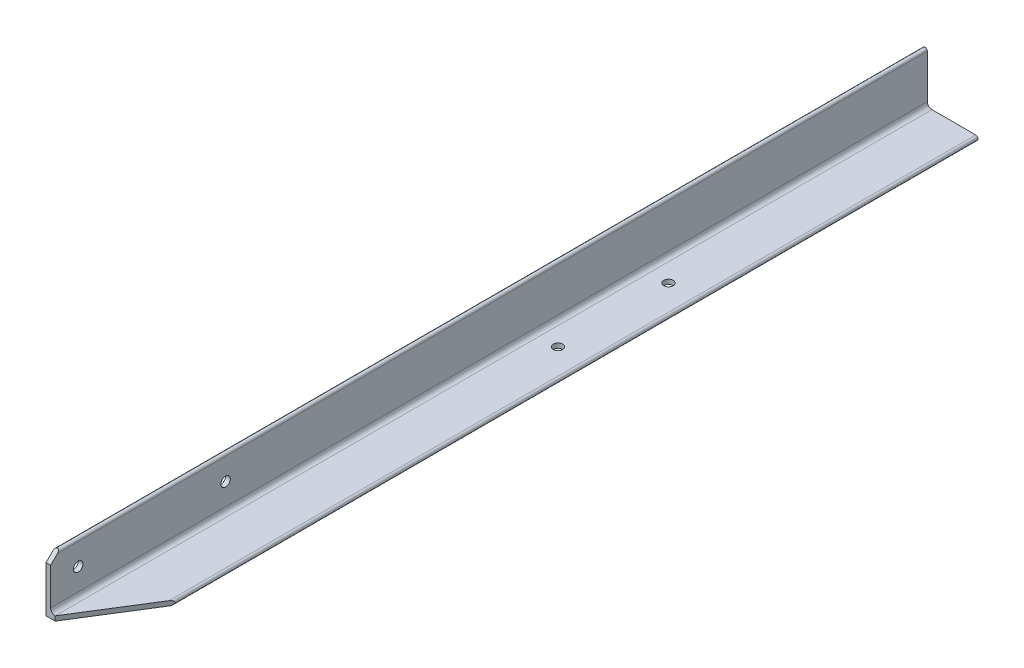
ISO-10303-21;
HEADER;
FILE_DESCRIPTION(('STEP AP214'),'2;1');
FILE_NAME('part.step','',(''),(''),'','','');
FILE_SCHEMA(('AUTOMOTIVE_DESIGN { 1 0 10303 214 1 1 1 1 }'));
ENDSEC;
DATA;
#1=APPLICATION_CONTEXT('core data for automotive mechanical design processes');
#2=APPLICATION_PROTOCOL_DEFINITION('international standard','automotive_design',2000,#1);
#3=PRODUCT_CONTEXT('',#1,'mechanical');
#4=PRODUCT('Part','Part','',(#3));
#5=PRODUCT_RELATED_PRODUCT_CATEGORY('part','',(#4));
#6=PRODUCT_DEFINITION_FORMATION('','',#4);
#7=PRODUCT_DEFINITION_CONTEXT('part definition',#1,'design');
#8=PRODUCT_DEFINITION('design','',#6,#7);
#9=PRODUCT_DEFINITION_SHAPE('','',#8);
#10=(LENGTH_UNIT() NAMED_UNIT(*) SI_UNIT(.MILLI.,.METRE.));
#11=(NAMED_UNIT(*) PLANE_ANGLE_UNIT() SI_UNIT($,.RADIAN.));
#12=(NAMED_UNIT(*) SI_UNIT($,.STERADIAN.) SOLID_ANGLE_UNIT());
#13=UNCERTAINTY_MEASURE_WITH_UNIT(LENGTH_MEASURE(1.E-05),#10,'distance_accuracy_value','');
#14=(GEOMETRIC_REPRESENTATION_CONTEXT(3) GLOBAL_UNCERTAINTY_ASSIGNED_CONTEXT((#13)) GLOBAL_UNIT_ASSIGNED_CONTEXT((#10,
#11,#12)) REPRESENTATION_CONTEXT('',''));
#15=CARTESIAN_POINT('',(0.,0.,0.));
#16=DIRECTION('',(0.,0.,1.));
#17=DIRECTION('',(1.,0.,0.));
#18=AXIS2_PLACEMENT_3D('',#15,#16,#17);
#19=CARTESIAN_POINT('',(0.,0.,302.24603));
#20=DIRECTION('',(0.,1.,0.));
#21=DIRECTION('',(-1.,0.,0.));
#22=AXIS2_PLACEMENT_3D('',#19,#20,#21);
#23=PLANE('',#22);
#24=CARTESIAN_POINT('',(19.0500000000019,0.,-107.888534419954));
#25=DIRECTION('',(0.,1.,0.));
#26=DIRECTION('',(-1.,0.,0.));
#27=AXIS2_PLACEMENT_3D('',#24,#25,#26);
#28=CIRCLE('',#27,3.2385);
#29=CARTESIAN_POINT('',(22.2885000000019,0.,-107.888534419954));
#30=VERTEX_POINT('',#29);
#31=EDGE_CURVE('E162',#30,#30,#28,.T.);
#32=ORIENTED_EDGE('',*,*,#31,.T.);
#33=EDGE_LOOP('',(#32));
#34=FACE_BOUND('',#33,.T.);
#35=CARTESIAN_POINT('',(19.0500000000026,0.,-31.6885344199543));
#36=DIRECTION('',(0.,1.,0.));
#37=DIRECTION('',(-1.,0.,0.));
#38=AXIS2_PLACEMENT_3D('',#35,#36,#37);
#39=CIRCLE('',#38,3.2385);
#40=CARTESIAN_POINT('',(22.2885000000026,0.,-31.6885344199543));
#41=VERTEX_POINT('',#40);
#42=EDGE_CURVE('E116',#41,#41,#39,.T.);
#43=ORIENTED_EDGE('',*,*,#42,.T.);
#44=EDGE_LOOP('',(#43));
#45=FACE_BOUND('',#44,.T.);
#46=DIRECTION('',(0.,0.,-1.));
#47=VECTOR('',#46,1.);
#48=CARTESIAN_POINT('',(36.5125,0.,302.24603));
#49=LINE('',#48,#47);
#50=CARTESIAN_POINT('',(36.5125,0.,253.98603));
#51=VERTEX_POINT('',#50);
#52=CARTESIAN_POINT('',(36.5125,0.,-302.24603));
#53=VERTEX_POINT('',#52);
#54=EDGE_CURVE('E40',#51,#53,#49,.T.);
#55=ORIENTED_EDGE('',*,*,#54,.F.);
#56=DIRECTION('',(0.52999894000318,0.,-0.847998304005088));
#57=VECTOR('',#56,1.);
#58=CARTESIAN_POINT('',(38.1,0.,251.44603));
#59=LINE('',#58,#57);
#60=CARTESIAN_POINT('',(6.35,0.,302.24603));
#61=VERTEX_POINT('',#60);
#62=EDGE_CURVE('E109',#61,#51,#59,.T.);
#63=ORIENTED_EDGE('',*,*,#62,.F.);
#64=DIRECTION('',(1.,0.,0.));
#65=VECTOR('',#64,1.);
#66=CARTESIAN_POINT('',(0.,0.,302.24603));
#67=LINE('',#66,#65);
#68=CARTESIAN_POINT('',(0.,0.,302.24603));
#69=VERTEX_POINT('',#68);
#70=EDGE_CURVE('E114',#69,#61,#67,.T.);
#71=ORIENTED_EDGE('',*,*,#70,.F.);
#72=DIRECTION('',(0.,0.,-1.));
#73=VECTOR('',#72,1.);
#74=CARTESIAN_POINT('',(0.,0.,302.24603));
#75=LINE('',#74,#73);
#76=CARTESIAN_POINT('',(0.,0.,-302.24603));
#77=VERTEX_POINT('',#76);
#78=EDGE_CURVE('E132',#69,#77,#75,.T.);
#79=ORIENTED_EDGE('',*,*,#78,.T.);
#80=DIRECTION('',(1.,0.,0.));
#81=VECTOR('',#80,1.);
#82=CARTESIAN_POINT('',(0.,0.,-302.24603));
#83=LINE('',#82,#81);
#84=EDGE_CURVE('E133',#77,#53,#83,.T.);
#85=ORIENTED_EDGE('',*,*,#84,.T.);
#86=EDGE_LOOP('',(#55,#63,#71,#79,#85));
#87=FACE_BOUND('',#86,.T.);
#88=ADVANCED_FACE('F32',(#34,#45,#87),#23,.F.);
#89=CARTESIAN_POINT('',(36.5125,1.5875,302.24603));
#90=DIRECTION('',(0.,0.,-1.));
#91=DIRECTION('',(-1.,0.,0.));
#92=AXIS2_PLACEMENT_3D('',#89,#90,#91);
#93=CYLINDRICAL_SURFACE('',#92,1.5875);
#94=CARTESIAN_POINT('',(36.5125,1.5875,253.98603));
#95=DIRECTION('',(-0.847998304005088,0.,-0.52999894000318));
#96=DIRECTION('',(0.52999894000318,0.,-0.847998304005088));
#97=AXIS2_PLACEMENT_3D('',#94,#95,#96);
#98=ELLIPSE('',#97,2.99528900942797,1.5875);
#99=CARTESIAN_POINT('',(36.5125,3.175,253.98603));
#100=VERTEX_POINT('',#99);
#101=EDGE_CURVE('E174',#100,#51,#98,.T.);
#102=ORIENTED_EDGE('',*,*,#101,.T.);
#103=ORIENTED_EDGE('',*,*,#54,.T.);
#104=CARTESIAN_POINT('',(36.5125,1.5875,-302.24603));
#105=DIRECTION('',(0.,0.,1.));
#106=DIRECTION('',(1.,0.,0.));
#107=AXIS2_PLACEMENT_3D('',#104,#105,#106);
#108=CIRCLE('',#107,1.5875);
#109=CARTESIAN_POINT('',(36.5125,3.175,-302.24603));
#110=VERTEX_POINT('',#109);
#111=EDGE_CURVE('E135',#53,#110,#108,.T.);
#112=ORIENTED_EDGE('',*,*,#111,.T.);
#113=DIRECTION('',(0.,0.,-1.));
#114=VECTOR('',#113,1.);
#115=CARTESIAN_POINT('',(36.5125,3.175,302.24603));
#116=LINE('',#115,#114);
#117=EDGE_CURVE('E158',#100,#110,#116,.T.);
#118=ORIENTED_EDGE('',*,*,#117,.F.);
#119=EDGE_LOOP('',(#102,#103,#112,#118));
#120=FACE_BOUND('',#119,.T.);
#121=ADVANCED_FACE('F223',(#120),#93,.T.);
#122=CARTESIAN_POINT('',(6.35000000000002,3.175,302.24603));
#123=DIRECTION('',(0.,-1.,0.));
#124=DIRECTION('',(0.,0.,-1.));
#125=AXIS2_PLACEMENT_3D('',#122,#123,#124);
#126=PLANE('',#125);
#127=CARTESIAN_POINT('',(19.0500000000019,3.175,-107.888534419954));
#128=DIRECTION('',(0.,-1.,0.));
#129=DIRECTION('',(0.,0.,-1.));
#130=AXIS2_PLACEMENT_3D('',#127,#128,#129);
#131=CIRCLE('',#130,3.2385);
#132=CARTESIAN_POINT('',(22.2885000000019,3.175,-107.888534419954));
#133=VERTEX_POINT('',#132);
#134=EDGE_CURVE('E35',#133,#133,#131,.T.);
#135=ORIENTED_EDGE('',*,*,#134,.T.);
#136=EDGE_LOOP('',(#135));
#137=FACE_BOUND('',#136,.T.);
#138=CARTESIAN_POINT('',(19.0500000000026,3.175,-31.6885344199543));
#139=DIRECTION('',(0.,-1.,0.));
#140=DIRECTION('',(0.,0.,-1.));
#141=AXIS2_PLACEMENT_3D('',#138,#139,#140);
#142=CIRCLE('',#141,3.2385);
#143=CARTESIAN_POINT('',(22.2885000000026,3.175,-31.6885344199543));
#144=VERTEX_POINT('',#143);
#145=EDGE_CURVE('E160',#144,#144,#142,.T.);
#146=ORIENTED_EDGE('',*,*,#145,.T.);
#147=EDGE_LOOP('',(#146));
#148=FACE_BOUND('',#147,.T.);
#149=DIRECTION('',(0.,0.,-1.));
#150=VECTOR('',#149,1.);
#151=CARTESIAN_POINT('',(6.35000000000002,3.175,302.24603));
#152=LINE('',#151,#150);
#153=CARTESIAN_POINT('',(6.35000000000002,3.175,302.24603));
#154=VERTEX_POINT('',#153);
#155=CARTESIAN_POINT('',(6.35000000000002,3.175,-302.24603));
#156=VERTEX_POINT('',#155);
#157=EDGE_CURVE('E155',#154,#156,#152,.T.);
#158=ORIENTED_EDGE('',*,*,#157,.F.);
#159=DIRECTION('',(0.52999894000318,0.,-0.847998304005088));
#160=VECTOR('',#159,1.);
#161=CARTESIAN_POINT('',(6.35,3.175,302.24603));
#162=LINE('',#161,#160);
#163=EDGE_CURVE('E91',#154,#100,#162,.T.);
#164=ORIENTED_EDGE('',*,*,#163,.T.);
#165=ORIENTED_EDGE('',*,*,#117,.T.);
#166=DIRECTION('',(-1.,0.,0.));
#167=VECTOR('',#166,1.);
#168=CARTESIAN_POINT('',(6.35000000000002,3.175,-302.24603));
#169=LINE('',#168,#167);
#170=EDGE_CURVE('E138',#110,#156,#169,.T.);
#171=ORIENTED_EDGE('',*,*,#170,.T.);
#172=EDGE_LOOP('',(#158,#164,#165,#171));
#173=FACE_BOUND('',#172,.T.);
#174=ADVANCED_FACE('F227',(#137,#148,#173),#126,.F.);
#175=CARTESIAN_POINT('',(6.35,6.35,302.24603));
#176=DIRECTION('',(0.,0.,-1.));
#177=DIRECTION('',(-1.,0.,0.));
#178=AXIS2_PLACEMENT_3D('',#175,#176,#177);
#179=CYLINDRICAL_SURFACE('',#178,3.175);
#180=CARTESIAN_POINT('',(6.35,6.35,-302.24603));
#181=DIRECTION('',(0.,0.,-1.));
#182=DIRECTION('',(1.,0.,0.));
#183=AXIS2_PLACEMENT_3D('',#180,#181,#182);
#184=CIRCLE('',#183,3.175);
#185=CARTESIAN_POINT('',(3.175,6.35000000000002,-302.24603));
#186=VERTEX_POINT('',#185);
#187=EDGE_CURVE('E140',#156,#186,#184,.T.);
#188=ORIENTED_EDGE('',*,*,#187,.T.);
#189=DIRECTION('',(0.,0.,-1.));
#190=VECTOR('',#189,1.);
#191=CARTESIAN_POINT('',(3.175,6.35000000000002,302.24603));
#192=LINE('',#191,#190);
#193=CARTESIAN_POINT('',(3.175,6.35000000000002,302.24603));
#194=VERTEX_POINT('',#193);
#195=EDGE_CURVE('E152',#194,#186,#192,.T.);
#196=ORIENTED_EDGE('',*,*,#195,.F.);
#197=CARTESIAN_POINT('',(6.35,6.35,302.24603));
#198=DIRECTION('',(0.,0.,-1.));
#199=DIRECTION('',(1.,0.,0.));
#200=AXIS2_PLACEMENT_3D('',#197,#198,#199);
#201=CIRCLE('',#200,3.175);
#202=EDGE_CURVE('E119',#154,#194,#201,.T.);
#203=ORIENTED_EDGE('',*,*,#202,.F.);
#204=ORIENTED_EDGE('',*,*,#157,.T.);
#205=EDGE_LOOP('',(#188,#196,#203,#204));
#206=FACE_BOUND('',#205,.T.);
#207=ADVANCED_FACE('F294',(#206),#179,.F.);
#208=CARTESIAN_POINT('',(3.175,6.35000000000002,302.24603));
#209=DIRECTION('',(-1.,0.,0.));
#210=DIRECTION('',(0.,0.,1.));
#211=AXIS2_PLACEMENT_3D('',#208,#209,#210);
#212=PLANE('',#211);
#213=CARTESIAN_POINT('',(3.175,21.43125,283.19603));
#214=DIRECTION('',(1.,0.,0.));
#215=DIRECTION('',(0.,0.,-1.));
#216=AXIS2_PLACEMENT_3D('',#213,#214,#215);
#217=CIRCLE('',#216,3.23850000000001);
#218=CARTESIAN_POINT('',(3.175,21.43125,279.95753));
#219=VERTEX_POINT('',#218);
#220=EDGE_CURVE('E181',#219,#219,#217,.T.);
#221=ORIENTED_EDGE('',*,*,#220,.F.);
#222=EDGE_LOOP('',(#221));
#223=FACE_BOUND('',#222,.T.);
#224=CARTESIAN_POINT('',(3.175,21.43125,181.59603));
#225=DIRECTION('',(1.,0.,0.));
#226=DIRECTION('',(0.,0.,-1.));
#227=AXIS2_PLACEMENT_3D('',#224,#225,#226);
#228=CIRCLE('',#227,3.23850000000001);
#229=CARTESIAN_POINT('',(3.175,21.43125,178.35753));
#230=VERTEX_POINT('',#229);
#231=EDGE_CURVE('E176',#230,#230,#228,.T.);
#232=ORIENTED_EDGE('',*,*,#231,.F.);
#233=EDGE_LOOP('',(#232));
#234=FACE_BOUND('',#233,.T.);
#235=DIRECTION('',(0.,0.,-1.));
#236=VECTOR('',#235,1.);
#237=CARTESIAN_POINT('',(3.175,36.5125,302.24603));
#238=LINE('',#237,#236);
#239=CARTESIAN_POINT('',(3.175,36.5125,297.48353));
#240=VERTEX_POINT('',#239);
#241=CARTESIAN_POINT('',(3.175,36.5125,-302.24603));
#242=VERTEX_POINT('',#241);
#243=EDGE_CURVE('E150',#240,#242,#238,.T.);
#244=ORIENTED_EDGE('',*,*,#243,.F.);
#245=DIRECTION('',(0.,0.707106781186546,-0.707106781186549));
#246=VECTOR('',#245,1.);
#247=CARTESIAN_POINT('',(3.175,31.75,302.24603));
#248=LINE('',#247,#246);
#249=CARTESIAN_POINT('',(3.175,31.75,302.24603));
#250=VERTEX_POINT('',#249);
#251=EDGE_CURVE('E180',#250,#240,#248,.T.);
#252=ORIENTED_EDGE('',*,*,#251,.F.);
#253=DIRECTION('',(0.,1.,0.));
#254=VECTOR('',#253,1.);
#255=CARTESIAN_POINT('',(3.175,6.35000000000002,302.24603));
#256=LINE('',#255,#254);
#257=EDGE_CURVE('E121',#194,#250,#256,.T.);
#258=ORIENTED_EDGE('',*,*,#257,.F.);
#259=ORIENTED_EDGE('',*,*,#195,.T.);
#260=DIRECTION('',(0.,1.,0.));
#261=VECTOR('',#260,1.);
#262=CARTESIAN_POINT('',(3.175,6.35000000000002,-302.24603));
#263=LINE('',#262,#261);
#264=EDGE_CURVE('E142',#186,#242,#263,.T.);
#265=ORIENTED_EDGE('',*,*,#264,.T.);
#266=EDGE_LOOP('',(#244,#252,#258,#259,#265));
#267=FACE_BOUND('',#266,.T.);
#268=ADVANCED_FACE('F200',(#223,#234,#267),#212,.F.);
#269=CARTESIAN_POINT('',(1.5875,36.5125,302.24603));
#270=DIRECTION('',(0.,0.,-1.));
#271=DIRECTION('',(-1.,0.,0.));
#272=AXIS2_PLACEMENT_3D('',#269,#270,#271);
#273=CYLINDRICAL_SURFACE('',#272,1.5875);
#274=CARTESIAN_POINT('',(1.5875,36.5125,297.48353));
#275=DIRECTION('',(0.,-0.707106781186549,-0.707106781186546));
#276=DIRECTION('',(0.,0.707106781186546,-0.707106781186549));
#277=AXIS2_PLACEMENT_3D('',#274,#275,#276);
#278=ELLIPSE('',#277,2.24506403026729,1.5875);
#279=CARTESIAN_POINT('',(0.,36.5125,297.48353));
#280=VERTEX_POINT('',#279);
#281=EDGE_CURVE('E126',#280,#240,#278,.T.);
#282=ORIENTED_EDGE('',*,*,#281,.T.);
#283=ORIENTED_EDGE('',*,*,#243,.T.);
#284=CARTESIAN_POINT('',(1.5875,36.5125,-302.24603));
#285=DIRECTION('',(0.,0.,1.));
#286=DIRECTION('',(1.,0.,0.));
#287=AXIS2_PLACEMENT_3D('',#284,#285,#286);
#288=CIRCLE('',#287,1.5875);
#289=CARTESIAN_POINT('',(0.,36.5125,-302.24603));
#290=VERTEX_POINT('',#289);
#291=EDGE_CURVE('E123',#242,#290,#288,.T.);
#292=ORIENTED_EDGE('',*,*,#291,.T.);
#293=DIRECTION('',(0.,0.,-1.));
#294=VECTOR('',#293,1.);
#295=CARTESIAN_POINT('',(0.,36.5125,302.24603));
#296=LINE('',#295,#294);
#297=EDGE_CURVE('E148',#280,#290,#296,.T.);
#298=ORIENTED_EDGE('',*,*,#297,.F.);
#299=EDGE_LOOP('',(#282,#283,#292,#298));
#300=FACE_BOUND('',#299,.T.);
#301=ADVANCED_FACE('F195',(#300),#273,.T.);
#302=CARTESIAN_POINT('',(0.,0.,302.24603));
#303=DIRECTION('',(1.,0.,0.));
#304=DIRECTION('',(0.,1.,0.));
#305=AXIS2_PLACEMENT_3D('',#302,#303,#304);
#306=PLANE('',#305);
#307=CARTESIAN_POINT('',(0.,21.43125,283.19603));
#308=DIRECTION('',(1.,0.,0.));
#309=DIRECTION('',(0.,0.,-1.));
#310=AXIS2_PLACEMENT_3D('',#307,#308,#309);
#311=CIRCLE('',#310,3.23850000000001);
#312=CARTESIAN_POINT('',(0.,21.43125,279.95753));
#313=VERTEX_POINT('',#312);
#314=EDGE_CURVE('E177',#313,#313,#311,.T.);
#315=ORIENTED_EDGE('',*,*,#314,.T.);
#316=EDGE_LOOP('',(#315));
#317=FACE_BOUND('',#316,.T.);
#318=CARTESIAN_POINT('',(0.,21.43125,181.59603));
#319=DIRECTION('',(1.,0.,0.));
#320=DIRECTION('',(0.,0.,-1.));
#321=AXIS2_PLACEMENT_3D('',#318,#319,#320);
#322=CIRCLE('',#321,3.23850000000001);
#323=CARTESIAN_POINT('',(0.,21.43125,178.35753));
#324=VERTEX_POINT('',#323);
#325=EDGE_CURVE('E184',#324,#324,#322,.T.);
#326=ORIENTED_EDGE('',*,*,#325,.T.);
#327=EDGE_LOOP('',(#326));
#328=FACE_BOUND('',#327,.T.);
#329=DIRECTION('',(0.,-1.,0.));
#330=VECTOR('',#329,1.);
#331=CARTESIAN_POINT('',(0.,0.,302.24603));
#332=LINE('',#331,#330);
#333=CARTESIAN_POINT('',(0.,31.75,302.24603));
#334=VERTEX_POINT('',#333);
#335=EDGE_CURVE('E56',#334,#69,#332,.T.);
#336=ORIENTED_EDGE('',*,*,#335,.F.);
#337=DIRECTION('',(0.,0.707106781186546,-0.707106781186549));
#338=VECTOR('',#337,1.);
#339=CARTESIAN_POINT('',(0.,31.75,302.24603));
#340=LINE('',#339,#338);
#341=EDGE_CURVE('E48',#334,#280,#340,.T.);
#342=ORIENTED_EDGE('',*,*,#341,.T.);
#343=ORIENTED_EDGE('',*,*,#297,.T.);
#344=DIRECTION('',(0.,-1.,0.));
#345=VECTOR('',#344,1.);
#346=CARTESIAN_POINT('',(0.,0.,-302.24603));
#347=LINE('',#346,#345);
#348=EDGE_CURVE('E85',#290,#77,#347,.T.);
#349=ORIENTED_EDGE('',*,*,#348,.T.);
#350=ORIENTED_EDGE('',*,*,#78,.F.);
#351=EDGE_LOOP('',(#336,#342,#343,#349,#350));
#352=FACE_BOUND('',#351,.T.);
#353=ADVANCED_FACE('F210',(#317,#328,#352),#306,.F.);
#354=CARTESIAN_POINT('',(36.5125,1.5875,302.24603));
#355=DIRECTION('',(0.,0.,1.));
#356=DIRECTION('',(1.,0.,0.));
#357=AXIS2_PLACEMENT_3D('',#354,#355,#356);
#358=PLANE('',#357);
#359=DIRECTION('',(0.,-1.,0.));
#360=VECTOR('',#359,1.);
#361=CARTESIAN_POINT('',(6.35,1.5875,302.24603));
#362=LINE('',#361,#360);
#363=EDGE_CURVE('E11',#154,#61,#362,.T.);
#364=ORIENTED_EDGE('',*,*,#363,.F.);
#365=ORIENTED_EDGE('',*,*,#202,.T.);
#366=ORIENTED_EDGE('',*,*,#257,.T.);
#367=DIRECTION('',(1.,0.,0.));
#368=VECTOR('',#367,1.);
#369=CARTESIAN_POINT('',(0.,31.75,302.24603));
#370=LINE('',#369,#368);
#371=EDGE_CURVE('E190',#334,#250,#370,.T.);
#372=ORIENTED_EDGE('',*,*,#371,.F.);
#373=ORIENTED_EDGE('',*,*,#335,.T.);
#374=ORIENTED_EDGE('',*,*,#70,.T.);
#375=EDGE_LOOP('',(#364,#365,#366,#372,#373,#374));
#376=FACE_BOUND('',#375,.T.);
#377=ADVANCED_FACE('F118',(#376),#358,.T.);
#378=CARTESIAN_POINT('',(36.5125,1.5875,-302.24603));
#379=DIRECTION('',(0.,0.,1.));
#380=DIRECTION('',(1.,0.,0.));
#381=AXIS2_PLACEMENT_3D('',#378,#379,#380);
#382=PLANE('',#381);
#383=ORIENTED_EDGE('',*,*,#84,.F.);
#384=ORIENTED_EDGE('',*,*,#348,.F.);
#385=ORIENTED_EDGE('',*,*,#291,.F.);
#386=ORIENTED_EDGE('',*,*,#264,.F.);
#387=ORIENTED_EDGE('',*,*,#187,.F.);
#388=ORIENTED_EDGE('',*,*,#170,.F.);
#389=ORIENTED_EDGE('',*,*,#111,.F.);
#390=EDGE_LOOP('',(#383,#384,#385,#386,#387,#388,#389));
#391=FACE_BOUND('',#390,.T.);
#392=ADVANCED_FACE('F207',(#391),#382,.F.);
#393=CARTESIAN_POINT('',(0.,31.75,302.24603));
#394=DIRECTION('',(0.,-0.707106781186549,-0.707106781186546));
#395=DIRECTION('',(0.,0.707106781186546,-0.707106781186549));
#396=AXIS2_PLACEMENT_3D('',#393,#394,#395);
#397=PLANE('',#396);
#398=ORIENTED_EDGE('',*,*,#281,.F.);
#399=ORIENTED_EDGE('',*,*,#341,.F.);
#400=ORIENTED_EDGE('',*,*,#371,.T.);
#401=ORIENTED_EDGE('',*,*,#251,.T.);
#402=EDGE_LOOP('',(#398,#399,#400,#401));
#403=FACE_BOUND('',#402,.T.);
#404=ADVANCED_FACE('F197',(#403),#397,.F.);
#405=CARTESIAN_POINT('',(0.,21.43125,181.59603));
#406=DIRECTION('',(1.,0.,0.));
#407=DIRECTION('',(0.,0.,-1.));
#408=AXIS2_PLACEMENT_3D('',#405,#406,#407);
#409=CYLINDRICAL_SURFACE('',#408,3.23850000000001);
#410=ORIENTED_EDGE('',*,*,#325,.F.);
#411=EDGE_LOOP('',(#410));
#412=FACE_BOUND('',#411,.T.);
#413=ORIENTED_EDGE('',*,*,#231,.T.);
#414=EDGE_LOOP('',(#413));
#415=FACE_BOUND('',#414,.T.);
#416=ADVANCED_FACE('F248',(#412,#415),#409,.F.);
#417=CARTESIAN_POINT('',(0.,21.43125,283.19603));
#418=DIRECTION('',(1.,0.,0.));
#419=DIRECTION('',(0.,0.,-1.));
#420=AXIS2_PLACEMENT_3D('',#417,#418,#419);
#421=CYLINDRICAL_SURFACE('',#420,3.23850000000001);
#422=ORIENTED_EDGE('',*,*,#314,.F.);
#423=EDGE_LOOP('',(#422));
#424=FACE_BOUND('',#423,.T.);
#425=ORIENTED_EDGE('',*,*,#220,.T.);
#426=EDGE_LOOP('',(#425));
#427=FACE_BOUND('',#426,.T.);
#428=ADVANCED_FACE('F243',(#424,#427),#421,.F.);
#429=CARTESIAN_POINT('',(38.1,38.1,251.44603));
#430=DIRECTION('',(-0.847998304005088,0.,-0.52999894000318));
#431=DIRECTION('',(-0.52999894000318,0.,0.847998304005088));
#432=AXIS2_PLACEMENT_3D('',#429,#430,#431);
#433=PLANE('',#432);
#434=ORIENTED_EDGE('',*,*,#101,.F.);
#435=ORIENTED_EDGE('',*,*,#163,.F.);
#436=ORIENTED_EDGE('',*,*,#363,.T.);
#437=ORIENTED_EDGE('',*,*,#62,.T.);
#438=EDGE_LOOP('',(#434,#435,#436,#437));
#439=FACE_BOUND('',#438,.T.);
#440=ADVANCED_FACE('F108',(#439),#433,.F.);
#441=CARTESIAN_POINT('',(19.0500000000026,38.1,-31.6885344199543));
#442=DIRECTION('',(0.,-1.,0.));
#443=DIRECTION('',(1.,0.,0.));
#444=AXIS2_PLACEMENT_3D('',#441,#442,#443);
#445=CYLINDRICAL_SURFACE('',#444,3.2385);
#446=CARTESIAN_POINT('',(22.2885000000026,3.175,-31.6885344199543));
#447=CARTESIAN_POINT('',(22.2885000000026,3.14192708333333,-31.6885344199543));
#448=CARTESIAN_POINT('',(22.2885000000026,3.10885416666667,-31.6885344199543));
#449=CARTESIAN_POINT('',(22.2885000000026,3.04270833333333,-31.6885344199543));
#450=CARTESIAN_POINT('',(22.2885000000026,3.00963541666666,-31.6885344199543));
#451=CARTESIAN_POINT('',(22.2885000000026,2.94348958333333,-31.6885344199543));
#452=CARTESIAN_POINT('',(22.2885000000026,2.91041666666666,-31.6885344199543));
#453=CARTESIAN_POINT('',(22.2885000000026,2.84427083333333,-31.6885344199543));
#454=CARTESIAN_POINT('',(22.2885000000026,2.81119791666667,-31.6885344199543));
#455=CARTESIAN_POINT('',(22.2885000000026,2.74505208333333,-31.6885344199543));
#456=CARTESIAN_POINT('',(22.2885000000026,2.71197916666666,-31.6885344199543));
#457=CARTESIAN_POINT('',(22.2885000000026,2.64583333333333,-31.6885344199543));
#458=CARTESIAN_POINT('',(22.2885000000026,2.61276041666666,-31.6885344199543));
#459=CARTESIAN_POINT('',(22.2885000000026,2.54661458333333,-31.6885344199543));
#460=CARTESIAN_POINT('',(22.2885000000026,2.51354166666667,-31.6885344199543));
#461=CARTESIAN_POINT('',(22.2885000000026,2.44739583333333,-31.6885344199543));
#462=CARTESIAN_POINT('',(22.2885000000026,2.41432291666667,-31.6885344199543));
#463=CARTESIAN_POINT('',(22.2885000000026,2.34817708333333,-31.6885344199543));
#464=CARTESIAN_POINT('',(22.2885000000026,2.31510416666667,-31.6885344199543));
#465=CARTESIAN_POINT('',(22.2885000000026,2.24895833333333,-31.6885344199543));
#466=CARTESIAN_POINT('',(22.2885000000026,2.21588541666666,-31.6885344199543));
#467=CARTESIAN_POINT('',(22.2885000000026,2.14973958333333,-31.6885344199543));
#468=CARTESIAN_POINT('',(22.2885000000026,2.11666666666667,-31.6885344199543));
#469=CARTESIAN_POINT('',(22.2885000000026,2.05052083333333,-31.6885344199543));
#470=CARTESIAN_POINT('',(22.2885000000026,2.01744791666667,-31.6885344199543));
#471=CARTESIAN_POINT('',(22.2885000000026,1.95130208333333,-31.6885344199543));
#472=CARTESIAN_POINT('',(22.2885000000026,1.91822916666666,-31.6885344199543));
#473=CARTESIAN_POINT('',(22.2885000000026,1.85208333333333,-31.6885344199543));
#474=CARTESIAN_POINT('',(22.2885000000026,1.81901041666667,-31.6885344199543));
#475=CARTESIAN_POINT('',(22.2885000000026,1.75286458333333,-31.6885344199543));
#476=CARTESIAN_POINT('',(22.2885000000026,1.71979166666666,-31.6885344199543));
#477=CARTESIAN_POINT('',(22.2885000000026,1.65364583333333,-31.6885344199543));
#478=CARTESIAN_POINT('',(22.2885000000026,1.62057291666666,-31.6885344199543));
#479=CARTESIAN_POINT('',(22.2885000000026,1.55442708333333,-31.6885344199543));
#480=CARTESIAN_POINT('',(22.2885000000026,1.52135416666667,-31.6885344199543));
#481=CARTESIAN_POINT('',(22.2885000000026,1.45520833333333,-31.6885344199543));
#482=CARTESIAN_POINT('',(22.2885000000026,1.42213541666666,-31.6885344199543));
#483=CARTESIAN_POINT('',(22.2885000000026,1.35598958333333,-31.6885344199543));
#484=CARTESIAN_POINT('',(22.2885000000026,1.32291666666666,-31.6885344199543));
#485=CARTESIAN_POINT('',(22.2885000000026,1.25677083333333,-31.6885344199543));
#486=CARTESIAN_POINT('',(22.2885000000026,1.22369791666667,-31.6885344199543));
#487=CARTESIAN_POINT('',(22.2885000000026,1.15755208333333,-31.6885344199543));
#488=CARTESIAN_POINT('',(22.2885000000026,1.12447916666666,-31.6885344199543));
#489=CARTESIAN_POINT('',(22.2885000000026,1.05833333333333,-31.6885344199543));
#490=CARTESIAN_POINT('',(22.2885000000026,1.02526041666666,-31.6885344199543));
#491=CARTESIAN_POINT('',(22.2885000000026,0.959114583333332,-31.6885344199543));
#492=CARTESIAN_POINT('',(22.2885000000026,0.926041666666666,-31.6885344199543));
#493=CARTESIAN_POINT('',(22.2885000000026,0.859895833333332,-31.6885344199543));
#494=CARTESIAN_POINT('',(22.2885000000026,0.826822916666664,-31.6885344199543));
#495=CARTESIAN_POINT('',(22.2885000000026,0.76067708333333,-31.6885344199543));
#496=CARTESIAN_POINT('',(22.2885000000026,0.727604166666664,-31.6885344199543));
#497=CARTESIAN_POINT('',(22.2885000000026,0.661458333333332,-31.6885344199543));
#498=CARTESIAN_POINT('',(22.2885000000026,0.628385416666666,-31.6885344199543));
#499=CARTESIAN_POINT('',(22.2885000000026,0.562239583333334,-31.6885344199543));
#500=CARTESIAN_POINT('',(22.2885000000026,0.529166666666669,-31.6885344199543));
#501=CARTESIAN_POINT('',(22.2885000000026,0.463020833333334,-31.6885344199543));
#502=CARTESIAN_POINT('',(22.2885000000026,0.429947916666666,-31.6885344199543));
#503=CARTESIAN_POINT('',(22.2885000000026,0.363802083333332,-31.6885344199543));
#504=CARTESIAN_POINT('',(22.2885000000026,0.330729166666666,-31.6885344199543));
#505=CARTESIAN_POINT('',(22.2885000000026,0.264583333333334,-31.6885344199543));
#506=CARTESIAN_POINT('',(22.2885000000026,0.231510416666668,-31.6885344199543));
#507=CARTESIAN_POINT('',(22.2885000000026,0.165364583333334,-31.6885344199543));
#508=CARTESIAN_POINT('',(22.2885000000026,0.132291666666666,-31.6885344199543));
#509=CARTESIAN_POINT('',(22.2885000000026,0.0661458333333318,-31.6885344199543));
#510=CARTESIAN_POINT('',(22.2885000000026,0.0330729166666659,-31.6885344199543));
#511=CARTESIAN_POINT('',(22.2885000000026,0.,-31.6885344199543));
#512=B_SPLINE_CURVE_WITH_KNOTS('',3,(#446,#447,#448,#449,#450,#451,#452,#453,#454,#455,#456,
#457,#458,#459,#460,#461,#462,#463,#464,#465,#466,#467,#468,#469,#470,#471,#472,#473,#474,#475,
#476,#477,#478,#479,#480,#481,#482,#483,#484,#485,#486,#487,#488,#489,#490,#491,#492,#493,#494,
#495,#496,#497,#498,#499,#500,#501,#502,#503,#504,#505,#506,#507,#508,#509,#510,#511),
.UNSPECIFIED.,.F.,.F.,(4,2,2,2,2,2,2,2,2,2,2,2,2,2,2,2,2,2,2,2,2,2,2,2,2,2,2,2,2,2,2,2,4),(0.,
0.0992187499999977,0.198437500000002,0.29765625,0.396874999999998,0.496093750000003,0.5953125,
0.694531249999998,0.793749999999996,0.892968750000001,0.992187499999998,1.09140625,1.190625,
1.28984375,1.3890625,1.48828125,1.5875,1.68671875,1.7859375,1.88515625,1.984375,2.08359375,
2.1828125,2.28203125,2.38125,2.48046875,2.5796875,2.67890624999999,2.778125,2.87734375,
2.97656249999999,3.07578125,3.175),.UNSPECIFIED.);
#513=EDGE_CURVE('BSEAM232',#144,#41,#512,.T.);
#514=ORIENTED_EDGE('',*,*,#145,.F.);
#515=ORIENTED_EDGE('',*,*,#42,.F.);
#516=ORIENTED_EDGE('',*,*,#513,.T.);
#517=ORIENTED_EDGE('',*,*,#513,.F.);
#518=EDGE_LOOP('',(#514,#516,#515,#517));
#519=FACE_BOUND('',#518,.T.);
#520=ADVANCED_FACE('F232',(#519),#445,.F.);
#521=CARTESIAN_POINT('',(19.0500000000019,38.1,-107.888534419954));
#522=DIRECTION('',(0.,-1.,0.));
#523=DIRECTION('',(1.,0.,0.));
#524=AXIS2_PLACEMENT_3D('',#521,#522,#523);
#525=CYLINDRICAL_SURFACE('',#524,3.2385);
#526=CARTESIAN_POINT('',(22.2885000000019,3.175,-107.888534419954));
#527=CARTESIAN_POINT('',(22.2885000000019,3.14192708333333,-107.888534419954));
#528=CARTESIAN_POINT('',(22.2885000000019,3.10885416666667,-107.888534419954));
#529=CARTESIAN_POINT('',(22.2885000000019,3.04270833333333,-107.888534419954));
#530=CARTESIAN_POINT('',(22.2885000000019,3.00963541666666,-107.888534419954));
#531=CARTESIAN_POINT('',(22.2885000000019,2.94348958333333,-107.888534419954));
#532=CARTESIAN_POINT('',(22.2885000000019,2.91041666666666,-107.888534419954));
#533=CARTESIAN_POINT('',(22.2885000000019,2.84427083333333,-107.888534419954));
#534=CARTESIAN_POINT('',(22.2885000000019,2.81119791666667,-107.888534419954));
#535=CARTESIAN_POINT('',(22.2885000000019,2.74505208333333,-107.888534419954));
#536=CARTESIAN_POINT('',(22.2885000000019,2.71197916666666,-107.888534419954));
#537=CARTESIAN_POINT('',(22.2885000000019,2.64583333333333,-107.888534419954));
#538=CARTESIAN_POINT('',(22.2885000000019,2.61276041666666,-107.888534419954));
#539=CARTESIAN_POINT('',(22.2885000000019,2.54661458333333,-107.888534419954));
#540=CARTESIAN_POINT('',(22.2885000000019,2.51354166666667,-107.888534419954));
#541=CARTESIAN_POINT('',(22.2885000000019,2.44739583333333,-107.888534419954));
#542=CARTESIAN_POINT('',(22.2885000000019,2.41432291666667,-107.888534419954));
#543=CARTESIAN_POINT('',(22.2885000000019,2.34817708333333,-107.888534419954));
#544=CARTESIAN_POINT('',(22.2885000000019,2.31510416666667,-107.888534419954));
#545=CARTESIAN_POINT('',(22.2885000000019,2.24895833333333,-107.888534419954));
#546=CARTESIAN_POINT('',(22.2885000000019,2.21588541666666,-107.888534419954));
#547=CARTESIAN_POINT('',(22.2885000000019,2.14973958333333,-107.888534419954));
#548=CARTESIAN_POINT('',(22.2885000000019,2.11666666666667,-107.888534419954));
#549=CARTESIAN_POINT('',(22.2885000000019,2.05052083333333,-107.888534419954));
#550=CARTESIAN_POINT('',(22.2885000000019,2.01744791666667,-107.888534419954));
#551=CARTESIAN_POINT('',(22.2885000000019,1.95130208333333,-107.888534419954));
#552=CARTESIAN_POINT('',(22.2885000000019,1.91822916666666,-107.888534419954));
#553=CARTESIAN_POINT('',(22.2885000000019,1.85208333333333,-107.888534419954));
#554=CARTESIAN_POINT('',(22.2885000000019,1.81901041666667,-107.888534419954));
#555=CARTESIAN_POINT('',(22.2885000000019,1.75286458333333,-107.888534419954));
#556=CARTESIAN_POINT('',(22.2885000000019,1.71979166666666,-107.888534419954));
#557=CARTESIAN_POINT('',(22.2885000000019,1.65364583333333,-107.888534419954));
#558=CARTESIAN_POINT('',(22.2885000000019,1.62057291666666,-107.888534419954));
#559=CARTESIAN_POINT('',(22.2885000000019,1.55442708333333,-107.888534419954));
#560=CARTESIAN_POINT('',(22.2885000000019,1.52135416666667,-107.888534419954));
#561=CARTESIAN_POINT('',(22.2885000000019,1.45520833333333,-107.888534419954));
#562=CARTESIAN_POINT('',(22.2885000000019,1.42213541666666,-107.888534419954));
#563=CARTESIAN_POINT('',(22.2885000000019,1.35598958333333,-107.888534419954));
#564=CARTESIAN_POINT('',(22.2885000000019,1.32291666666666,-107.888534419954));
#565=CARTESIAN_POINT('',(22.2885000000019,1.25677083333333,-107.888534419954));
#566=CARTESIAN_POINT('',(22.2885000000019,1.22369791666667,-107.888534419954));
#567=CARTESIAN_POINT('',(22.2885000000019,1.15755208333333,-107.888534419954));
#568=CARTESIAN_POINT('',(22.2885000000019,1.12447916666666,-107.888534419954));
#569=CARTESIAN_POINT('',(22.2885000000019,1.05833333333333,-107.888534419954));
#570=CARTESIAN_POINT('',(22.2885000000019,1.02526041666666,-107.888534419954));
#571=CARTESIAN_POINT('',(22.2885000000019,0.959114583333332,-107.888534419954));
#572=CARTESIAN_POINT('',(22.2885000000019,0.926041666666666,-107.888534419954));
#573=CARTESIAN_POINT('',(22.2885000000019,0.859895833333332,-107.888534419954));
#574=CARTESIAN_POINT('',(22.2885000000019,0.826822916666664,-107.888534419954));
#575=CARTESIAN_POINT('',(22.2885000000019,0.76067708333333,-107.888534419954));
#576=CARTESIAN_POINT('',(22.2885000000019,0.727604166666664,-107.888534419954));
#577=CARTESIAN_POINT('',(22.2885000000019,0.661458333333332,-107.888534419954));
#578=CARTESIAN_POINT('',(22.2885000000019,0.628385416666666,-107.888534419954));
#579=CARTESIAN_POINT('',(22.2885000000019,0.562239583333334,-107.888534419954));
#580=CARTESIAN_POINT('',(22.2885000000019,0.529166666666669,-107.888534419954));
#581=CARTESIAN_POINT('',(22.2885000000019,0.463020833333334,-107.888534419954));
#582=CARTESIAN_POINT('',(22.2885000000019,0.429947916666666,-107.888534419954));
#583=CARTESIAN_POINT('',(22.2885000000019,0.363802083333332,-107.888534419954));
#584=CARTESIAN_POINT('',(22.2885000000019,0.330729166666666,-107.888534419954));
#585=CARTESIAN_POINT('',(22.2885000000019,0.264583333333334,-107.888534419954));
#586=CARTESIAN_POINT('',(22.2885000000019,0.231510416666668,-107.888534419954));
#587=CARTESIAN_POINT('',(22.2885000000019,0.165364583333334,-107.888534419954));
#588=CARTESIAN_POINT('',(22.2885000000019,0.132291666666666,-107.888534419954));
#589=CARTESIAN_POINT('',(22.2885000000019,0.0661458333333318,-107.888534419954));
#590=CARTESIAN_POINT('',(22.2885000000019,0.0330729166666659,-107.888534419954));
#591=CARTESIAN_POINT('',(22.2885000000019,0.,-107.888534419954));
#592=B_SPLINE_CURVE_WITH_KNOTS('',3,(#526,#527,#528,#529,#530,#531,#532,#533,#534,#535,#536,
#537,#538,#539,#540,#541,#542,#543,#544,#545,#546,#547,#548,#549,#550,#551,#552,#553,#554,#555,
#556,#557,#558,#559,#560,#561,#562,#563,#564,#565,#566,#567,#568,#569,#570,#571,#572,#573,#574,
#575,#576,#577,#578,#579,#580,#581,#582,#583,#584,#585,#586,#587,#588,#589,#590,#591),
.UNSPECIFIED.,.F.,.F.,(4,2,2,2,2,2,2,2,2,2,2,2,2,2,2,2,2,2,2,2,2,2,2,2,2,2,2,2,2,2,2,2,4),(0.,
0.0992187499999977,0.198437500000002,0.29765625,0.396874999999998,0.496093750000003,0.5953125,
0.694531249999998,0.793749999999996,0.892968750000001,0.992187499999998,1.09140625,1.190625,
1.28984375,1.3890625,1.48828125,1.5875,1.68671875,1.7859375,1.88515625,1.984375,2.08359375,
2.1828125,2.28203125,2.38125,2.48046875,2.5796875,2.67890624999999,2.778125,2.87734375,
2.97656249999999,3.07578125,3.175),.UNSPECIFIED.);
#593=EDGE_CURVE('BSEAM234',#133,#30,#592,.T.);
#594=ORIENTED_EDGE('',*,*,#134,.F.);
#595=ORIENTED_EDGE('',*,*,#31,.F.);
#596=ORIENTED_EDGE('',*,*,#593,.T.);
#597=ORIENTED_EDGE('',*,*,#593,.F.);
#598=EDGE_LOOP('',(#594,#596,#595,#597));
#599=FACE_BOUND('',#598,.T.);
#600=ADVANCED_FACE('F234',(#599),#525,.F.);
#601=CLOSED_SHELL('',(#88,#121,#174,#207,#268,#301,#353,#377,#392,#404,#416,#428,#440,#520,#600));
#602=MANIFOLD_SOLID_BREP('B2',#601);
#603=ADVANCED_BREP_SHAPE_REPRESENTATION('',(#18,#602),#14);
#604=SHAPE_DEFINITION_REPRESENTATION(#9,#603);
ENDSEC;
END-ISO-10303-21;
